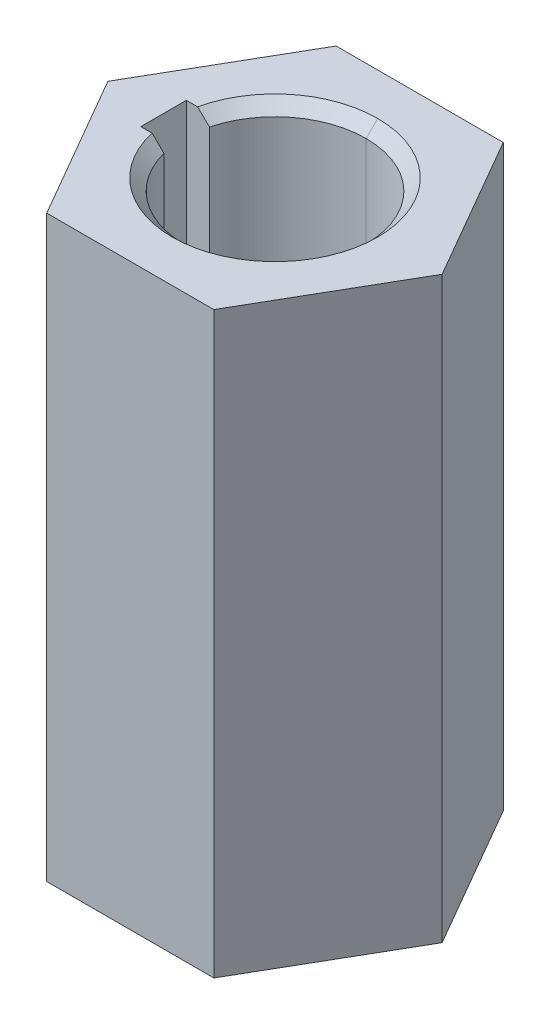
ISO-10303-21;
HEADER;
FILE_DESCRIPTION(('STEP AP214'),'2;1');
FILE_NAME('part.step','',(''),(''),'','','');
FILE_SCHEMA(('AUTOMOTIVE_DESIGN { 1 0 10303 214 1 1 1 1 }'));
ENDSEC;
DATA;
#1=APPLICATION_CONTEXT('core data for automotive mechanical design processes');
#2=APPLICATION_PROTOCOL_DEFINITION('international standard','automotive_design',2000,#1);
#3=PRODUCT_CONTEXT('',#1,'mechanical');
#4=PRODUCT('Part','Part','',(#3));
#5=PRODUCT_RELATED_PRODUCT_CATEGORY('part','',(#4));
#6=PRODUCT_DEFINITION_FORMATION('','',#4);
#7=PRODUCT_DEFINITION_CONTEXT('part definition',#1,'design');
#8=PRODUCT_DEFINITION('design','',#6,#7);
#9=PRODUCT_DEFINITION_SHAPE('','',#8);
#10=(LENGTH_UNIT() NAMED_UNIT(*) SI_UNIT(.MILLI.,.METRE.));
#11=(NAMED_UNIT(*) PLANE_ANGLE_UNIT() SI_UNIT($,.RADIAN.));
#12=(NAMED_UNIT(*) SI_UNIT($,.STERADIAN.) SOLID_ANGLE_UNIT());
#13=UNCERTAINTY_MEASURE_WITH_UNIT(LENGTH_MEASURE(1.E-05),#10,'distance_accuracy_value','');
#14=(GEOMETRIC_REPRESENTATION_CONTEXT(3) GLOBAL_UNCERTAINTY_ASSIGNED_CONTEXT((#13)) GLOBAL_UNIT_ASSIGNED_CONTEXT((#10,
#11,#12)) REPRESENTATION_CONTEXT('',''));
#15=CARTESIAN_POINT('',(0.,0.,0.));
#16=DIRECTION('',(0.,0.,1.));
#17=DIRECTION('',(1.,0.,0.));
#18=AXIS2_PLACEMENT_3D('',#15,#16,#17);
#19=CARTESIAN_POINT('',(0.,24.892,0.));
#20=DIRECTION('',(0.,1.,0.));
#21=DIRECTION('',(0.,0.,1.));
#22=AXIS2_PLACEMENT_3D('',#19,#20,#21);
#23=CONICAL_SURFACE('',#22,4.,0.785398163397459);
#24=DIRECTION('',(0.,0.70710678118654,0.707106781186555));
#25=VECTOR('',#24,1.);
#26=CARTESIAN_POINT('',(0.,24.892,4.));
#27=LINE('',#26,#25);
#28=CARTESIAN_POINT('',(0.,24.892,4.));
#29=VERTEX_POINT('',#28);
#30=CARTESIAN_POINT('',(0.,25.4,4.508));
#31=VERTEX_POINT('',#30);
#32=EDGE_CURVE('E200',#29,#31,#27,.T.);
#33=ORIENTED_EDGE('',*,*,#32,.F.);
#34=CARTESIAN_POINT('',(0.,24.892,0.));
#35=DIRECTION('',(0.,1.,0.));
#36=DIRECTION('',(0.,0.,1.));
#37=AXIS2_PLACEMENT_3D('',#34,#35,#36);
#38=CIRCLE('',#37,4.);
#39=CARTESIAN_POINT('',(-3.87298334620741,24.892,1.));
#40=VERTEX_POINT('',#39);
#41=EDGE_CURVE('E298',#40,#29,#38,.T.);
#42=ORIENTED_EDGE('',*,*,#41,.F.);
#43=CARTESIAN_POINT('',(-4.39568697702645,25.4,1.));
#44=CARTESIAN_POINT('',(-4.22173225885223,25.2303792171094,1.));
#45=CARTESIAN_POINT('',(-4.04753376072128,25.0610077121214,1.));
#46=CARTESIAN_POINT('',(-3.87298334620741,24.892,1.));
#47=(BOUNDED_CURVE() B_SPLINE_CURVE(3,(#43,#44,#45,#46),.UNSPECIFIED.,.F.,
.F.) B_SPLINE_CURVE_WITH_KNOTS((4,4),(0.,0.000728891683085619),
.UNSPECIFIED.) CURVE() GEOMETRIC_REPRESENTATION_ITEM() RATIONAL_B_SPLINE_CURVE((1.,1.,1.,1.)) REPRESENTATION_ITEM(''));
#48=CARTESIAN_POINT('',(-4.39568697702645,25.4,1.));
#49=VERTEX_POINT('',#48);
#50=EDGE_CURVE('E10',#49,#40,#47,.T.);
#51=ORIENTED_EDGE('',*,*,#50,.F.);
#52=CARTESIAN_POINT('',(0.,25.4,0.));
#53=DIRECTION('',(0.,-1.,0.));
#54=DIRECTION('',(0.,0.,1.));
#55=AXIS2_PLACEMENT_3D('',#52,#53,#54);
#56=CIRCLE('',#55,4.508);
#57=EDGE_CURVE('E277',#31,#49,#56,.T.);
#58=ORIENTED_EDGE('',*,*,#57,.F.);
#59=EDGE_LOOP('',(#33,#42,#51,#58));
#60=FACE_BOUND('',#59,.T.);
#61=ADVANCED_FACE('F16',(#60),#23,.F.);
#62=CARTESIAN_POINT('',(0.,0.,0.));
#63=DIRECTION('',(0.,-1.,0.));
#64=DIRECTION('',(0.,0.,-1.));
#65=AXIS2_PLACEMENT_3D('',#62,#63,#64);
#66=CONICAL_SURFACE('',#65,4.508,0.785398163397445);
#67=DIRECTION('',(0.,-0.70710678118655,-0.707106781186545));
#68=VECTOR('',#67,1.);
#69=CARTESIAN_POINT('',(0.,0.,-4.508));
#70=LINE('',#69,#68);
#71=CARTESIAN_POINT('',(0.,0.508,-4.));
#72=VERTEX_POINT('',#71);
#73=CARTESIAN_POINT('',(0.,0.,-4.508));
#74=VERTEX_POINT('',#73);
#75=EDGE_CURVE('E234',#72,#74,#70,.T.);
#76=ORIENTED_EDGE('',*,*,#75,.F.);
#77=CARTESIAN_POINT('',(0.,0.508,0.));
#78=DIRECTION('',(0.,-1.,0.));
#79=DIRECTION('',(0.,0.,1.));
#80=AXIS2_PLACEMENT_3D('',#77,#78,#79);
#81=CIRCLE('',#80,4.);
#82=CARTESIAN_POINT('',(-3.87298334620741,0.508,-1.));
#83=VERTEX_POINT('',#82);
#84=EDGE_CURVE('E183',#83,#72,#81,.T.);
#85=ORIENTED_EDGE('',*,*,#84,.F.);
#86=CARTESIAN_POINT('',(-4.39568697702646,0.,-1.));
#87=CARTESIAN_POINT('',(-4.22173225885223,0.169620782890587,-1.));
#88=CARTESIAN_POINT('',(-4.04753376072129,0.338992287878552,-1.));
#89=CARTESIAN_POINT('',(-3.87298334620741,0.508,-1.));
#90=(BOUNDED_CURVE() B_SPLINE_CURVE(3,(#86,#87,#88,#89),.UNSPECIFIED.,.F.,
.F.) B_SPLINE_CURVE_WITH_KNOTS((4,4),(0.,0.000728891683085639),
.UNSPECIFIED.) CURVE() GEOMETRIC_REPRESENTATION_ITEM() RATIONAL_B_SPLINE_CURVE((1.,1.,1.,1.)) REPRESENTATION_ITEM(''));
#91=CARTESIAN_POINT('',(-4.39568697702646,0.,-1.));
#92=VERTEX_POINT('',#91);
#93=EDGE_CURVE('E42',#92,#83,#90,.T.);
#94=ORIENTED_EDGE('',*,*,#93,.F.);
#95=CARTESIAN_POINT('',(0.,0.,0.));
#96=DIRECTION('',(0.,1.,0.));
#97=DIRECTION('',(0.,0.,1.));
#98=AXIS2_PLACEMENT_3D('',#95,#96,#97);
#99=CIRCLE('',#98,4.508);
#100=EDGE_CURVE('E228',#74,#92,#99,.T.);
#101=ORIENTED_EDGE('',*,*,#100,.F.);
#102=EDGE_LOOP('',(#76,#85,#94,#101));
#103=FACE_BOUND('',#102,.T.);
#104=ADVANCED_FACE('F395',(#103),#66,.F.);
#105=CARTESIAN_POINT('',(-3.87298334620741,25.4,1.));
#106=DIRECTION('',(0.,0.,-1.));
#107=DIRECTION('',(0.,-1.,0.));
#108=AXIS2_PLACEMENT_3D('',#105,#106,#107);
#109=PLANE('',#108);
#110=DIRECTION('',(0.,-1.,0.));
#111=VECTOR('',#110,1.);
#112=CARTESIAN_POINT('',(-3.87298334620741,25.4,1.));
#113=LINE('',#112,#111);
#114=CARTESIAN_POINT('',(-3.87298334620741,0.508,1.));
#115=VERTEX_POINT('',#114);
#116=EDGE_CURVE('E189',#40,#115,#113,.T.);
#117=ORIENTED_EDGE('',*,*,#116,.T.);
#118=CARTESIAN_POINT('',(-3.87298334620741,0.508,1.));
#119=CARTESIAN_POINT('',(-4.04753376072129,0.338992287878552,1.));
#120=CARTESIAN_POINT('',(-4.22173225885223,0.169620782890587,1.));
#121=CARTESIAN_POINT('',(-4.39568697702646,0.,1.));
#122=(BOUNDED_CURVE() B_SPLINE_CURVE(3,(#118,#119,#120,#121),.UNSPECIFIED.,.F.,
.F.) B_SPLINE_CURVE_WITH_KNOTS((4,4),(0.,0.000728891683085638),
.UNSPECIFIED.) CURVE() GEOMETRIC_REPRESENTATION_ITEM() RATIONAL_B_SPLINE_CURVE((1.,1.,1.,1.)) REPRESENTATION_ITEM(''));
#123=CARTESIAN_POINT('',(-4.39568697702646,0.,1.));
#124=VERTEX_POINT('',#123);
#125=EDGE_CURVE('E288',#115,#124,#122,.T.);
#126=ORIENTED_EDGE('',*,*,#125,.T.);
#127=DIRECTION('',(1.,0.,0.));
#128=VECTOR('',#127,1.);
#129=CARTESIAN_POINT('',(-3.87298334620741,0.,1.));
#130=LINE('',#129,#128);
#131=CARTESIAN_POINT('',(-4.89,0.,1.));
#132=VERTEX_POINT('',#131);
#133=EDGE_CURVE('E233',#132,#124,#130,.T.);
#134=ORIENTED_EDGE('',*,*,#133,.F.);
#135=DIRECTION('',(0.,-1.,0.));
#136=VECTOR('',#135,1.);
#137=CARTESIAN_POINT('',(-4.89,25.4,1.));
#138=LINE('',#137,#136);
#139=CARTESIAN_POINT('',(-4.89,25.4,1.));
#140=VERTEX_POINT('',#139);
#141=EDGE_CURVE('E27',#140,#132,#138,.T.);
#142=ORIENTED_EDGE('',*,*,#141,.F.);
#143=DIRECTION('',(1.,0.,0.));
#144=VECTOR('',#143,1.);
#145=CARTESIAN_POINT('',(-3.87298334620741,25.4,1.));
#146=LINE('',#145,#144);
#147=EDGE_CURVE('E324',#140,#49,#146,.T.);
#148=ORIENTED_EDGE('',*,*,#147,.T.);
#149=ORIENTED_EDGE('',*,*,#50,.T.);
#150=EDGE_LOOP('',(#117,#126,#134,#142,#148,#149));
#151=FACE_BOUND('',#150,.T.);
#152=ADVANCED_FACE('F422',(#151),#109,.T.);
#153=CARTESIAN_POINT('',(-4.89,25.4,-1.));
#154=DIRECTION('',(1.,0.,0.));
#155=DIRECTION('',(0.,1.,0.));
#156=AXIS2_PLACEMENT_3D('',#153,#154,#155);
#157=PLANE('',#156);
#158=DIRECTION('',(0.,0.,1.));
#159=VECTOR('',#158,1.);
#160=CARTESIAN_POINT('',(-4.89,0.,-1.));
#161=LINE('',#160,#159);
#162=CARTESIAN_POINT('',(-4.89,0.,-1.));
#163=VERTEX_POINT('',#162);
#164=EDGE_CURVE('E248',#163,#132,#161,.T.);
#165=ORIENTED_EDGE('',*,*,#164,.F.);
#166=DIRECTION('',(0.,-1.,0.));
#167=VECTOR('',#166,1.);
#168=CARTESIAN_POINT('',(-4.89,25.4,-1.));
#169=LINE('',#168,#167);
#170=CARTESIAN_POINT('',(-4.89,25.4,-1.));
#171=VERTEX_POINT('',#170);
#172=EDGE_CURVE('E270',#171,#163,#169,.T.);
#173=ORIENTED_EDGE('',*,*,#172,.F.);
#174=DIRECTION('',(0.,0.,1.));
#175=VECTOR('',#174,1.);
#176=CARTESIAN_POINT('',(-4.89,25.4,-1.));
#177=LINE('',#176,#175);
#178=EDGE_CURVE('E244',#171,#140,#177,.T.);
#179=ORIENTED_EDGE('',*,*,#178,.T.);
#180=ORIENTED_EDGE('',*,*,#141,.T.);
#181=EDGE_LOOP('',(#165,#173,#179,#180));
#182=FACE_BOUND('',#181,.T.);
#183=ADVANCED_FACE('F388',(#182),#157,.T.);
#184=CARTESIAN_POINT('',(-4.89,25.4,-1.));
#185=DIRECTION('',(0.,0.,1.));
#186=DIRECTION('',(1.,0.,0.));
#187=AXIS2_PLACEMENT_3D('',#184,#185,#186);
#188=PLANE('',#187);
#189=DIRECTION('',(-1.,0.,0.));
#190=VECTOR('',#189,1.);
#191=CARTESIAN_POINT('',(-4.89,0.,-1.));
#192=LINE('',#191,#190);
#193=EDGE_CURVE('E232',#92,#163,#192,.T.);
#194=ORIENTED_EDGE('',*,*,#193,.F.);
#195=ORIENTED_EDGE('',*,*,#93,.T.);
#196=DIRECTION('',(0.,-1.,0.));
#197=VECTOR('',#196,1.);
#198=CARTESIAN_POINT('',(-3.87298334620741,25.4,-1.));
#199=LINE('',#198,#197);
#200=CARTESIAN_POINT('',(-3.87298334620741,24.892,-1.));
#201=VERTEX_POINT('',#200);
#202=EDGE_CURVE('E316',#201,#83,#199,.T.);
#203=ORIENTED_EDGE('',*,*,#202,.F.);
#204=CARTESIAN_POINT('',(-3.87298334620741,24.892,-1.));
#205=CARTESIAN_POINT('',(-4.04753376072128,25.0610077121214,-1.));
#206=CARTESIAN_POINT('',(-4.22173225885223,25.2303792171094,-1.));
#207=CARTESIAN_POINT('',(-4.39568697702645,25.4,-1.));
#208=(BOUNDED_CURVE() B_SPLINE_CURVE(3,(#204,#205,#206,#207),.UNSPECIFIED.,.F.,
.F.) B_SPLINE_CURVE_WITH_KNOTS((4,4),(0.,0.000728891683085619),
.UNSPECIFIED.) CURVE() GEOMETRIC_REPRESENTATION_ITEM() RATIONAL_B_SPLINE_CURVE((1.,1.,1.,1.)) REPRESENTATION_ITEM(''));
#209=CARTESIAN_POINT('',(-4.39568697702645,25.4,-1.));
#210=VERTEX_POINT('',#209);
#211=EDGE_CURVE('E201',#201,#210,#208,.T.);
#212=ORIENTED_EDGE('',*,*,#211,.T.);
#213=DIRECTION('',(-1.,0.,0.));
#214=VECTOR('',#213,1.);
#215=CARTESIAN_POINT('',(-4.89,25.4,-1.));
#216=LINE('',#215,#214);
#217=EDGE_CURVE('E253',#210,#171,#216,.T.);
#218=ORIENTED_EDGE('',*,*,#217,.T.);
#219=ORIENTED_EDGE('',*,*,#172,.T.);
#220=EDGE_LOOP('',(#194,#195,#203,#212,#218,#219));
#221=FACE_BOUND('',#220,.T.);
#222=ADVANCED_FACE('F380',(#221),#188,.T.);
#223=CARTESIAN_POINT('',(0.,25.4,0.));
#224=DIRECTION('',(0.,-1.,0.));
#225=DIRECTION('',(0.,0.,-1.));
#226=AXIS2_PLACEMENT_3D('',#223,#224,#225);
#227=CYLINDRICAL_SURFACE('',#226,4.);
#228=DIRECTION('',(0.,-1.,0.));
#229=VECTOR('',#228,1.);
#230=CARTESIAN_POINT('',(0.,25.4,-4.));
#231=LINE('',#230,#229);
#232=CARTESIAN_POINT('',(0.,24.892,-4.));
#233=VERTEX_POINT('',#232);
#234=EDGE_CURVE('E177',#233,#72,#231,.T.);
#235=ORIENTED_EDGE('',*,*,#234,.F.);
#236=CARTESIAN_POINT('',(0.,24.892,0.));
#237=DIRECTION('',(0.,1.,0.));
#238=DIRECTION('',(0.,0.,1.));
#239=AXIS2_PLACEMENT_3D('',#236,#237,#238);
#240=CIRCLE('',#239,4.);
#241=EDGE_CURVE('E182',#233,#201,#240,.T.);
#242=ORIENTED_EDGE('',*,*,#241,.T.);
#243=ORIENTED_EDGE('',*,*,#202,.T.);
#244=ORIENTED_EDGE('',*,*,#84,.T.);
#245=EDGE_LOOP('',(#235,#242,#243,#244));
#246=FACE_BOUND('',#245,.T.);
#247=ADVANCED_FACE('F179',(#246),#227,.F.);
#248=CARTESIAN_POINT('',(-7.33234841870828,25.4,0.));
#249=DIRECTION('',(0.866025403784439,0.,-0.5));
#250=DIRECTION('',(0.,-1.,0.));
#251=AXIS2_PLACEMENT_3D('',#248,#249,#250);
#252=PLANE('',#251);
#253=DIRECTION('',(0.5,0.,0.866025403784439));
#254=VECTOR('',#253,1.);
#255=CARTESIAN_POINT('',(-7.33234841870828,0.,0.));
#256=LINE('',#255,#254);
#257=CARTESIAN_POINT('',(-7.33234841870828,0.,0.));
#258=VERTEX_POINT('',#257);
#259=CARTESIAN_POINT('',(-3.66617420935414,0.,6.35));
#260=VERTEX_POINT('',#259);
#261=EDGE_CURVE('E225',#258,#260,#256,.T.);
#262=ORIENTED_EDGE('',*,*,#261,.T.);
#263=DIRECTION('',(0.,-1.,0.));
#264=VECTOR('',#263,1.);
#265=CARTESIAN_POINT('',(-3.66617420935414,25.4,6.35));
#266=LINE('',#265,#264);
#267=CARTESIAN_POINT('',(-3.66617420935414,25.4,6.35));
#268=VERTEX_POINT('',#267);
#269=EDGE_CURVE('E265',#268,#260,#266,.T.);
#270=ORIENTED_EDGE('',*,*,#269,.F.);
#271=DIRECTION('',(0.5,0.,0.866025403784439));
#272=VECTOR('',#271,1.);
#273=CARTESIAN_POINT('',(-7.33234841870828,25.4,0.));
#274=LINE('',#273,#272);
#275=CARTESIAN_POINT('',(-7.33234841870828,25.4,0.));
#276=VERTEX_POINT('',#275);
#277=EDGE_CURVE('E249',#276,#268,#274,.T.);
#278=ORIENTED_EDGE('',*,*,#277,.F.);
#279=DIRECTION('',(0.,-1.,0.));
#280=VECTOR('',#279,1.);
#281=CARTESIAN_POINT('',(-7.33234841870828,25.4,0.));
#282=LINE('',#281,#280);
#283=EDGE_CURVE('E306',#276,#258,#282,.T.);
#284=ORIENTED_EDGE('',*,*,#283,.T.);
#285=EDGE_LOOP('',(#262,#270,#278,#284));
#286=FACE_BOUND('',#285,.T.);
#287=ADVANCED_FACE('F498',(#286),#252,.F.);
#288=CARTESIAN_POINT('',(-3.66617420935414,25.4,-6.35));
#289=DIRECTION('',(0.866025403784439,0.,0.5));
#290=DIRECTION('',(0.,-1.,0.));
#291=AXIS2_PLACEMENT_3D('',#288,#289,#290);
#292=PLANE('',#291);
#293=DIRECTION('',(-0.5,0.,0.866025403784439));
#294=VECTOR('',#293,1.);
#295=CARTESIAN_POINT('',(-3.66617420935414,0.,-6.35));
#296=LINE('',#295,#294);
#297=CARTESIAN_POINT('',(-3.66617420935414,0.,-6.35));
#298=VERTEX_POINT('',#297);
#299=EDGE_CURVE('E334',#298,#258,#296,.T.);
#300=ORIENTED_EDGE('',*,*,#299,.T.);
#301=ORIENTED_EDGE('',*,*,#283,.F.);
#302=DIRECTION('',(-0.5,0.,0.866025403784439));
#303=VECTOR('',#302,1.);
#304=CARTESIAN_POINT('',(-3.66617420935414,25.4,-6.35));
#305=LINE('',#304,#303);
#306=CARTESIAN_POINT('',(-3.66617420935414,25.4,-6.35));
#307=VERTEX_POINT('',#306);
#308=EDGE_CURVE('E254',#307,#276,#305,.T.);
#309=ORIENTED_EDGE('',*,*,#308,.F.);
#310=DIRECTION('',(0.,-1.,0.));
#311=VECTOR('',#310,1.);
#312=CARTESIAN_POINT('',(-3.66617420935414,25.4,-6.35));
#313=LINE('',#312,#311);
#314=EDGE_CURVE('E118',#307,#298,#313,.T.);
#315=ORIENTED_EDGE('',*,*,#314,.T.);
#316=EDGE_LOOP('',(#300,#301,#309,#315));
#317=FACE_BOUND('',#316,.T.);
#318=ADVANCED_FACE('F437',(#317),#292,.F.);
#319=CARTESIAN_POINT('',(3.66617420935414,25.4,-6.35));
#320=DIRECTION('',(0.,0.,1.));
#321=DIRECTION('',(1.,0.,0.));
#322=AXIS2_PLACEMENT_3D('',#319,#320,#321);
#323=PLANE('',#322);
#324=DIRECTION('',(-1.,0.,0.));
#325=VECTOR('',#324,1.);
#326=CARTESIAN_POINT('',(3.66617420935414,0.,-6.35));
#327=LINE('',#326,#325);
#328=CARTESIAN_POINT('',(3.66617420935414,0.,-6.35));
#329=VERTEX_POINT('',#328);
#330=EDGE_CURVE('E329',#329,#298,#327,.T.);
#331=ORIENTED_EDGE('',*,*,#330,.T.);
#332=ORIENTED_EDGE('',*,*,#314,.F.);
#333=DIRECTION('',(-1.,0.,0.));
#334=VECTOR('',#333,1.);
#335=CARTESIAN_POINT('',(3.66617420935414,25.4,-6.35));
#336=LINE('',#335,#334);
#337=CARTESIAN_POINT('',(3.66617420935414,25.4,-6.35));
#338=VERTEX_POINT('',#337);
#339=EDGE_CURVE('E283',#338,#307,#336,.T.);
#340=ORIENTED_EDGE('',*,*,#339,.F.);
#341=DIRECTION('',(0.,-1.,0.));
#342=VECTOR('',#341,1.);
#343=CARTESIAN_POINT('',(3.66617420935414,25.4,-6.35));
#344=LINE('',#343,#342);
#345=EDGE_CURVE('E130',#338,#329,#344,.T.);
#346=ORIENTED_EDGE('',*,*,#345,.T.);
#347=EDGE_LOOP('',(#331,#332,#340,#346));
#348=FACE_BOUND('',#347,.T.);
#349=ADVANCED_FACE('F431',(#348),#323,.F.);
#350=CARTESIAN_POINT('',(7.33234841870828,25.4,0.));
#351=DIRECTION('',(-0.866025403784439,0.,0.5));
#352=DIRECTION('',(0.,1.,0.));
#353=AXIS2_PLACEMENT_3D('',#350,#351,#352);
#354=PLANE('',#353);
#355=DIRECTION('',(-0.5,0.,-0.866025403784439));
#356=VECTOR('',#355,1.);
#357=CARTESIAN_POINT('',(7.33234841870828,0.,0.));
#358=LINE('',#357,#356);
#359=CARTESIAN_POINT('',(7.33234841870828,0.,0.));
#360=VERTEX_POINT('',#359);
#361=EDGE_CURVE('E325',#360,#329,#358,.T.);
#362=ORIENTED_EDGE('',*,*,#361,.T.);
#363=ORIENTED_EDGE('',*,*,#345,.F.);
#364=DIRECTION('',(-0.5,0.,-0.866025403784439));
#365=VECTOR('',#364,1.);
#366=CARTESIAN_POINT('',(7.33234841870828,25.4,0.));
#367=LINE('',#366,#365);
#368=CARTESIAN_POINT('',(7.33234841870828,25.4,0.));
#369=VERTEX_POINT('',#368);
#370=EDGE_CURVE('E295',#369,#338,#367,.T.);
#371=ORIENTED_EDGE('',*,*,#370,.F.);
#372=DIRECTION('',(0.,-1.,0.));
#373=VECTOR('',#372,1.);
#374=CARTESIAN_POINT('',(7.33234841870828,25.4,0.));
#375=LINE('',#374,#373);
#376=EDGE_CURVE('E259',#369,#360,#375,.T.);
#377=ORIENTED_EDGE('',*,*,#376,.T.);
#378=EDGE_LOOP('',(#362,#363,#371,#377));
#379=FACE_BOUND('',#378,.T.);
#380=ADVANCED_FACE('F436',(#379),#354,.F.);
#381=CARTESIAN_POINT('',(3.66617420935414,25.4,6.35));
#382=DIRECTION('',(-0.866025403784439,0.,-0.5));
#383=DIRECTION('',(-0.5,0.,0.866025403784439));
#384=AXIS2_PLACEMENT_3D('',#381,#382,#383);
#385=PLANE('',#384);
#386=DIRECTION('',(0.5,0.,-0.866025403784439));
#387=VECTOR('',#386,1.);
#388=CARTESIAN_POINT('',(3.66617420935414,0.,6.35));
#389=LINE('',#388,#387);
#390=CARTESIAN_POINT('',(3.66617420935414,0.,6.35));
#391=VERTEX_POINT('',#390);
#392=EDGE_CURVE('E328',#391,#360,#389,.T.);
#393=ORIENTED_EDGE('',*,*,#392,.T.);
#394=ORIENTED_EDGE('',*,*,#376,.F.);
#395=DIRECTION('',(0.5,0.,-0.866025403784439));
#396=VECTOR('',#395,1.);
#397=CARTESIAN_POINT('',(3.66617420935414,25.4,6.35));
#398=LINE('',#397,#396);
#399=CARTESIAN_POINT('',(3.66617420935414,25.4,6.35));
#400=VERTEX_POINT('',#399);
#401=EDGE_CURVE('E340',#400,#369,#398,.T.);
#402=ORIENTED_EDGE('',*,*,#401,.F.);
#403=DIRECTION('',(0.,-1.,0.));
#404=VECTOR('',#403,1.);
#405=CARTESIAN_POINT('',(3.66617420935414,25.4,6.35));
#406=LINE('',#405,#404);
#407=EDGE_CURVE('E300',#400,#391,#406,.T.);
#408=ORIENTED_EDGE('',*,*,#407,.T.);
#409=EDGE_LOOP('',(#393,#394,#402,#408));
#410=FACE_BOUND('',#409,.T.);
#411=ADVANCED_FACE('F18',(#410),#385,.F.);
#412=CARTESIAN_POINT('',(-3.66617420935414,25.4,6.35));
#413=DIRECTION('',(0.,0.,-1.));
#414=DIRECTION('',(-1.,0.,0.));
#415=AXIS2_PLACEMENT_3D('',#412,#413,#414);
#416=PLANE('',#415);
#417=DIRECTION('',(1.,0.,0.));
#418=VECTOR('',#417,1.);
#419=CARTESIAN_POINT('',(-3.66617420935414,0.,6.35));
#420=LINE('',#419,#418);
#421=EDGE_CURVE('E240',#260,#391,#420,.T.);
#422=ORIENTED_EDGE('',*,*,#421,.T.);
#423=ORIENTED_EDGE('',*,*,#407,.F.);
#424=DIRECTION('',(1.,0.,0.));
#425=VECTOR('',#424,1.);
#426=CARTESIAN_POINT('',(-3.66617420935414,25.4,6.35));
#427=LINE('',#426,#425);
#428=EDGE_CURVE('E188',#268,#400,#427,.T.);
#429=ORIENTED_EDGE('',*,*,#428,.F.);
#430=ORIENTED_EDGE('',*,*,#269,.T.);
#431=EDGE_LOOP('',(#422,#423,#429,#430));
#432=FACE_BOUND('',#431,.T.);
#433=ADVANCED_FACE('F481',(#432),#416,.F.);
#434=CARTESIAN_POINT('',(0.,0.,0.));
#435=DIRECTION('',(0.,1.,0.));
#436=DIRECTION('',(1.,0.,0.));
#437=AXIS2_PLACEMENT_3D('',#434,#435,#436);
#438=PLANE('',#437);
#439=ORIENTED_EDGE('',*,*,#133,.T.);
#440=CARTESIAN_POINT('',(0.,0.,0.));
#441=DIRECTION('',(0.,1.,0.));
#442=DIRECTION('',(0.,0.,1.));
#443=AXIS2_PLACEMENT_3D('',#440,#441,#442);
#444=CIRCLE('',#443,4.508);
#445=CARTESIAN_POINT('',(0.,0.,4.508));
#446=VERTEX_POINT('',#445);
#447=EDGE_CURVE('E20',#124,#446,#444,.T.);
#448=ORIENTED_EDGE('',*,*,#447,.T.);
#449=CARTESIAN_POINT('',(0.,0.,0.));
#450=DIRECTION('',(0.,1.,0.));
#451=DIRECTION('',(0.,0.,1.));
#452=AXIS2_PLACEMENT_3D('',#449,#450,#451);
#453=CIRCLE('',#452,4.508);
#454=EDGE_CURVE('E238',#446,#74,#453,.T.);
#455=ORIENTED_EDGE('',*,*,#454,.T.);
#456=ORIENTED_EDGE('',*,*,#100,.T.);
#457=ORIENTED_EDGE('',*,*,#193,.T.);
#458=ORIENTED_EDGE('',*,*,#164,.T.);
#459=EDGE_LOOP('',(#439,#448,#455,#456,#457,#458));
#460=FACE_BOUND('',#459,.T.);
#461=ORIENTED_EDGE('',*,*,#421,.F.);
#462=ORIENTED_EDGE('',*,*,#261,.F.);
#463=ORIENTED_EDGE('',*,*,#299,.F.);
#464=ORIENTED_EDGE('',*,*,#330,.F.);
#465=ORIENTED_EDGE('',*,*,#361,.F.);
#466=ORIENTED_EDGE('',*,*,#392,.F.);
#467=EDGE_LOOP('',(#461,#462,#463,#464,#465,#466));
#468=FACE_BOUND('',#467,.T.);
#469=ADVANCED_FACE('F391',(#460,#468),#438,.F.);
#470=CARTESIAN_POINT('',(0.,25.4,0.));
#471=DIRECTION('',(0.,1.,0.));
#472=DIRECTION('',(1.,0.,0.));
#473=AXIS2_PLACEMENT_3D('',#470,#471,#472);
#474=PLANE('',#473);
#475=ORIENTED_EDGE('',*,*,#217,.F.);
#476=CARTESIAN_POINT('',(0.,25.4,0.));
#477=DIRECTION('',(0.,-1.,0.));
#478=DIRECTION('',(0.,0.,1.));
#479=AXIS2_PLACEMENT_3D('',#476,#477,#478);
#480=CIRCLE('',#479,4.508);
#481=CARTESIAN_POINT('',(0.,25.4,-4.508));
#482=VERTEX_POINT('',#481);
#483=EDGE_CURVE('E212',#210,#482,#480,.T.);
#484=ORIENTED_EDGE('',*,*,#483,.T.);
#485=CARTESIAN_POINT('',(0.,25.4,0.));
#486=DIRECTION('',(0.,-1.,0.));
#487=DIRECTION('',(0.,0.,1.));
#488=AXIS2_PLACEMENT_3D('',#485,#486,#487);
#489=CIRCLE('',#488,4.508);
#490=EDGE_CURVE('E207',#482,#31,#489,.T.);
#491=ORIENTED_EDGE('',*,*,#490,.T.);
#492=ORIENTED_EDGE('',*,*,#57,.T.);
#493=ORIENTED_EDGE('',*,*,#147,.F.);
#494=ORIENTED_EDGE('',*,*,#178,.F.);
#495=EDGE_LOOP('',(#475,#484,#491,#492,#493,#494));
#496=FACE_BOUND('',#495,.T.);
#497=ORIENTED_EDGE('',*,*,#428,.T.);
#498=ORIENTED_EDGE('',*,*,#401,.T.);
#499=ORIENTED_EDGE('',*,*,#370,.T.);
#500=ORIENTED_EDGE('',*,*,#339,.T.);
#501=ORIENTED_EDGE('',*,*,#308,.T.);
#502=ORIENTED_EDGE('',*,*,#277,.T.);
#503=EDGE_LOOP('',(#497,#498,#499,#500,#501,#502));
#504=FACE_BOUND('',#503,.T.);
#505=ADVANCED_FACE('F382',(#496,#504),#474,.T.);
#506=CARTESIAN_POINT('',(0.,25.4,0.));
#507=DIRECTION('',(0.,-1.,0.));
#508=DIRECTION('',(0.,0.,-1.));
#509=AXIS2_PLACEMENT_3D('',#506,#507,#508);
#510=CYLINDRICAL_SURFACE('',#509,4.);
#511=DIRECTION('',(0.,-1.,0.));
#512=VECTOR('',#511,1.);
#513=CARTESIAN_POINT('',(0.,25.4,4.));
#514=LINE('',#513,#512);
#515=CARTESIAN_POINT('',(0.,0.508,4.));
#516=VERTEX_POINT('',#515);
#517=EDGE_CURVE('E195',#29,#516,#514,.T.);
#518=ORIENTED_EDGE('',*,*,#517,.F.);
#519=CARTESIAN_POINT('',(0.,24.892,0.));
#520=DIRECTION('',(0.,1.,0.));
#521=DIRECTION('',(0.,0.,1.));
#522=AXIS2_PLACEMENT_3D('',#519,#520,#521);
#523=CIRCLE('',#522,4.);
#524=EDGE_CURVE('E192',#29,#233,#523,.T.);
#525=ORIENTED_EDGE('',*,*,#524,.T.);
#526=ORIENTED_EDGE('',*,*,#234,.T.);
#527=CARTESIAN_POINT('',(0.,0.508,0.));
#528=DIRECTION('',(0.,-1.,0.));
#529=DIRECTION('',(0.,0.,1.));
#530=AXIS2_PLACEMENT_3D('',#527,#528,#529);
#531=CIRCLE('',#530,4.);
#532=EDGE_CURVE('E239',#72,#516,#531,.T.);
#533=ORIENTED_EDGE('',*,*,#532,.T.);
#534=EDGE_LOOP('',(#518,#525,#526,#533));
#535=FACE_BOUND('',#534,.T.);
#536=ADVANCED_FACE('F194',(#535),#510,.F.);
#537=CARTESIAN_POINT('',(0.,25.4,0.));
#538=DIRECTION('',(0.,-1.,0.));
#539=DIRECTION('',(0.,0.,-1.));
#540=AXIS2_PLACEMENT_3D('',#537,#538,#539);
#541=CYLINDRICAL_SURFACE('',#540,4.);
#542=ORIENTED_EDGE('',*,*,#41,.T.);
#543=ORIENTED_EDGE('',*,*,#517,.T.);
#544=CARTESIAN_POINT('',(0.,0.508,0.));
#545=DIRECTION('',(0.,-1.,0.));
#546=DIRECTION('',(0.,0.,1.));
#547=AXIS2_PLACEMENT_3D('',#544,#545,#546);
#548=CIRCLE('',#547,4.);
#549=EDGE_CURVE('E291',#516,#115,#548,.T.);
#550=ORIENTED_EDGE('',*,*,#549,.T.);
#551=ORIENTED_EDGE('',*,*,#116,.F.);
#552=EDGE_LOOP('',(#542,#543,#550,#551));
#553=FACE_BOUND('',#552,.T.);
#554=ADVANCED_FACE('F469',(#553),#541,.F.);
#555=CARTESIAN_POINT('',(0.,0.,0.));
#556=DIRECTION('',(0.,-1.,0.));
#557=DIRECTION('',(0.,0.,-1.));
#558=AXIS2_PLACEMENT_3D('',#555,#556,#557);
#559=CONICAL_SURFACE('',#558,4.508,0.785398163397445);
#560=DIRECTION('',(0.,-0.70710678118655,0.707106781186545));
#561=VECTOR('',#560,1.);
#562=CARTESIAN_POINT('',(0.,0.,4.508));
#563=LINE('',#562,#561);
#564=EDGE_CURVE('E355',#516,#446,#563,.T.);
#565=ORIENTED_EDGE('',*,*,#564,.F.);
#566=ORIENTED_EDGE('',*,*,#532,.F.);
#567=ORIENTED_EDGE('',*,*,#75,.T.);
#568=ORIENTED_EDGE('',*,*,#454,.F.);
#569=EDGE_LOOP('',(#565,#566,#567,#568));
#570=FACE_BOUND('',#569,.T.);
#571=ADVANCED_FACE('F399',(#570),#559,.F.);
#572=CARTESIAN_POINT('',(0.,0.,0.));
#573=DIRECTION('',(0.,-1.,0.));
#574=DIRECTION('',(0.,0.,-1.));
#575=AXIS2_PLACEMENT_3D('',#572,#573,#574);
#576=CONICAL_SURFACE('',#575,4.508,0.785398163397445);
#577=ORIENTED_EDGE('',*,*,#549,.F.);
#578=ORIENTED_EDGE('',*,*,#564,.T.);
#579=ORIENTED_EDGE('',*,*,#447,.F.);
#580=ORIENTED_EDGE('',*,*,#125,.F.);
#581=EDGE_LOOP('',(#577,#578,#579,#580));
#582=FACE_BOUND('',#581,.T.);
#583=ADVANCED_FACE('F405',(#582),#576,.F.);
#584=CARTESIAN_POINT('',(0.,24.892,0.));
#585=DIRECTION('',(0.,1.,0.));
#586=DIRECTION('',(0.,0.,1.));
#587=AXIS2_PLACEMENT_3D('',#584,#585,#586);
#588=CONICAL_SURFACE('',#587,4.,0.785398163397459);
#589=DIRECTION('',(0.,0.70710678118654,-0.707106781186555));
#590=VECTOR('',#589,1.);
#591=CARTESIAN_POINT('',(0.,24.892,-4.));
#592=LINE('',#591,#590);
#593=EDGE_CURVE('E204',#233,#482,#592,.T.);
#594=ORIENTED_EDGE('',*,*,#593,.F.);
#595=ORIENTED_EDGE('',*,*,#524,.F.);
#596=ORIENTED_EDGE('',*,*,#32,.T.);
#597=ORIENTED_EDGE('',*,*,#490,.F.);
#598=EDGE_LOOP('',(#594,#595,#596,#597));
#599=FACE_BOUND('',#598,.T.);
#600=ADVANCED_FACE('F205',(#599),#588,.F.);
#601=CARTESIAN_POINT('',(0.,24.892,0.));
#602=DIRECTION('',(0.,1.,0.));
#603=DIRECTION('',(0.,0.,1.));
#604=AXIS2_PLACEMENT_3D('',#601,#602,#603);
#605=CONICAL_SURFACE('',#604,4.,0.785398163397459);
#606=ORIENTED_EDGE('',*,*,#241,.F.);
#607=ORIENTED_EDGE('',*,*,#593,.T.);
#608=ORIENTED_EDGE('',*,*,#483,.F.);
#609=ORIENTED_EDGE('',*,*,#211,.F.);
#610=EDGE_LOOP('',(#606,#607,#608,#609));
#611=FACE_BOUND('',#610,.T.);
#612=ADVANCED_FACE('F215',(#611),#605,.F.);
#613=CLOSED_SHELL('',(#61,#104,#152,#183,#222,#247,#287,#318,#349,#380,#411,#433,#469,#505,#536,
#554,#571,#583,#600,#612));
#614=MANIFOLD_SOLID_BREP('B1',#613);
#615=ADVANCED_BREP_SHAPE_REPRESENTATION('',(#18,#614),#14);
#616=SHAPE_DEFINITION_REPRESENTATION(#9,#615);
ENDSEC;
END-ISO-10303-21;
